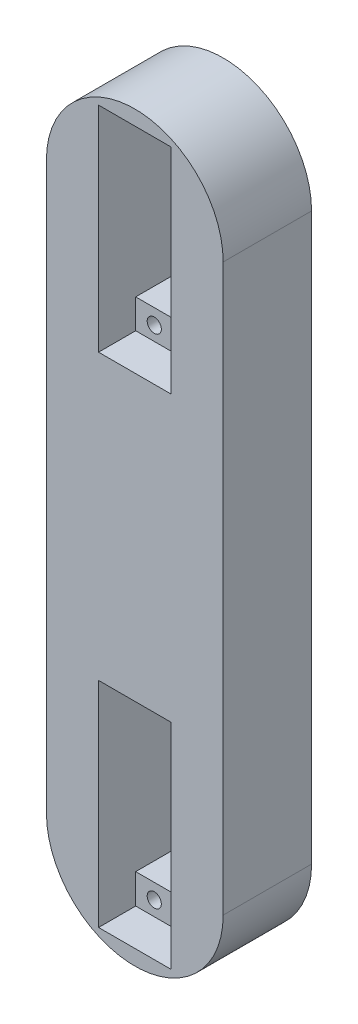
ISO-10303-21;
HEADER;
FILE_DESCRIPTION(('STEP AP214'),'2;1');
FILE_NAME('part.step','',(''),(''),'','','');
FILE_SCHEMA(('AUTOMOTIVE_DESIGN { 1 0 10303 214 1 1 1 1 }'));
ENDSEC;
DATA;
#1=APPLICATION_CONTEXT('core data for automotive mechanical design processes');
#2=APPLICATION_PROTOCOL_DEFINITION('international standard','automotive_design',2000,#1);
#3=PRODUCT_CONTEXT('',#1,'mechanical');
#4=PRODUCT('Part','Part','',(#3));
#5=PRODUCT_RELATED_PRODUCT_CATEGORY('part','',(#4));
#6=PRODUCT_DEFINITION_FORMATION('','',#4);
#7=PRODUCT_DEFINITION_CONTEXT('part definition',#1,'design');
#8=PRODUCT_DEFINITION('design','',#6,#7);
#9=PRODUCT_DEFINITION_SHAPE('','',#8);
#10=(LENGTH_UNIT() NAMED_UNIT(*) SI_UNIT(.MILLI.,.METRE.));
#11=(NAMED_UNIT(*) PLANE_ANGLE_UNIT() SI_UNIT($,.RADIAN.));
#12=(NAMED_UNIT(*) SI_UNIT($,.STERADIAN.) SOLID_ANGLE_UNIT());
#13=UNCERTAINTY_MEASURE_WITH_UNIT(LENGTH_MEASURE(1.E-05),#10,'distance_accuracy_value','');
#14=(GEOMETRIC_REPRESENTATION_CONTEXT(3) GLOBAL_UNCERTAINTY_ASSIGNED_CONTEXT((#13)) GLOBAL_UNIT_ASSIGNED_CONTEXT((#10,
#11,#12)) REPRESENTATION_CONTEXT('',''));
#15=CARTESIAN_POINT('',(0.,0.,0.));
#16=DIRECTION('',(0.,0.,1.));
#17=DIRECTION('',(1.,0.,0.));
#18=AXIS2_PLACEMENT_3D('',#15,#16,#17);
#19=CARTESIAN_POINT('',(5.,-148.153232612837,4.));
#20=DIRECTION('',(0.,0.,1.));
#21=DIRECTION('',(1.,0.,0.));
#22=AXIS2_PLACEMENT_3D('',#19,#20,#21);
#23=CYLINDRICAL_SURFACE('',#22,2.);
#24=CARTESIAN_POINT('',(5.,-148.153232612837,4.));
#25=DIRECTION('',(0.,0.,-1.));
#26=DIRECTION('',(0.,1.,0.));
#27=AXIS2_PLACEMENT_3D('',#24,#25,#26);
#28=CIRCLE('',#27,2.);
#29=CARTESIAN_POINT('',(5.,-146.153232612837,4.));
#30=VERTEX_POINT('',#29);
#31=EDGE_CURVE('E10',#30,#30,#28,.T.);
#32=ORIENTED_EDGE('',*,*,#31,.T.);
#33=EDGE_LOOP('',(#32));
#34=FACE_BOUND('',#33,.T.);
#35=CARTESIAN_POINT('',(5.,-148.153232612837,14.5));
#36=DIRECTION('',(0.,0.,-1.));
#37=DIRECTION('',(-1.,0.,0.));
#38=AXIS2_PLACEMENT_3D('',#35,#36,#37);
#39=CIRCLE('',#38,2.);
#40=CARTESIAN_POINT('',(3.,-148.153232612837,14.5));
#41=VERTEX_POINT('',#40);
#42=EDGE_CURVE('E468',#41,#41,#39,.T.);
#43=ORIENTED_EDGE('',*,*,#42,.F.);
#44=EDGE_LOOP('',(#43));
#45=FACE_BOUND('',#44,.T.);
#46=ADVANCED_FACE('F16',(#34,#45),#23,.F.);
#47=CARTESIAN_POINT('',(5.,-148.153232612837,4.));
#48=DIRECTION('',(0.,0.,-1.));
#49=DIRECTION('',(0.,-1.,0.));
#50=AXIS2_PLACEMENT_3D('',#47,#48,#49);
#51=PLANE('',#50);
#52=ORIENTED_EDGE('',*,*,#31,.F.);
#53=EDGE_LOOP('',(#52));
#54=FACE_BOUND('',#53,.T.);
#55=ADVANCED_FACE('F859',(#54),#51,.F.);
#56=CARTESIAN_POINT('',(5.,-96.0532326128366,4.));
#57=DIRECTION('',(0.,0.,1.));
#58=DIRECTION('',(1.,0.,0.));
#59=AXIS2_PLACEMENT_3D('',#56,#57,#58);
#60=CYLINDRICAL_SURFACE('',#59,2.);
#61=CARTESIAN_POINT('',(5.,-96.0532326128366,4.));
#62=DIRECTION('',(0.,0.,1.));
#63=DIRECTION('',(0.,1.,0.));
#64=AXIS2_PLACEMENT_3D('',#61,#62,#63);
#65=CIRCLE('',#64,2.);
#66=CARTESIAN_POINT('',(5.,-94.0532326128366,4.));
#67=VERTEX_POINT('',#66);
#68=EDGE_CURVE('E27',#67,#67,#65,.T.);
#69=ORIENTED_EDGE('',*,*,#68,.F.);
#70=EDGE_LOOP('',(#69));
#71=FACE_BOUND('',#70,.T.);
#72=CARTESIAN_POINT('',(5.,-96.0532326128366,14.5));
#73=DIRECTION('',(0.,0.,1.));
#74=DIRECTION('',(-1.,0.,0.));
#75=AXIS2_PLACEMENT_3D('',#72,#73,#74);
#76=CIRCLE('',#75,2.);
#77=CARTESIAN_POINT('',(3.,-96.0532326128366,14.5));
#78=VERTEX_POINT('',#77);
#79=EDGE_CURVE('E412',#78,#78,#76,.T.);
#80=ORIENTED_EDGE('',*,*,#79,.T.);
#81=EDGE_LOOP('',(#80));
#82=FACE_BOUND('',#81,.T.);
#83=ADVANCED_FACE('F864',(#71,#82),#60,.F.);
#84=CARTESIAN_POINT('',(5.,-96.0532326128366,4.));
#85=DIRECTION('',(0.,0.,1.));
#86=DIRECTION('',(1.,0.,0.));
#87=AXIS2_PLACEMENT_3D('',#84,#85,#86);
#88=PLANE('',#87);
#89=ORIENTED_EDGE('',*,*,#68,.T.);
#90=EDGE_LOOP('',(#89));
#91=FACE_BOUND('',#90,.T.);
#92=ADVANCED_FACE('F874',(#91),#88,.T.);
#93=CARTESIAN_POINT('',(-5.,-148.153232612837,4.));
#94=DIRECTION('',(0.,0.,1.));
#95=DIRECTION('',(1.,0.,0.));
#96=AXIS2_PLACEMENT_3D('',#93,#94,#95);
#97=CYLINDRICAL_SURFACE('',#96,2.);
#98=CARTESIAN_POINT('',(-5.,-148.153232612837,4.));
#99=DIRECTION('',(0.,0.,1.));
#100=DIRECTION('',(0.,1.,0.));
#101=AXIS2_PLACEMENT_3D('',#98,#99,#100);
#102=CIRCLE('',#101,2.);
#103=CARTESIAN_POINT('',(-5.,-146.153232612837,4.));
#104=VERTEX_POINT('',#103);
#105=EDGE_CURVE('E349',#104,#104,#102,.T.);
#106=ORIENTED_EDGE('',*,*,#105,.F.);
#107=EDGE_LOOP('',(#106));
#108=FACE_BOUND('',#107,.T.);
#109=CARTESIAN_POINT('',(-5.,-148.153232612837,14.5));
#110=DIRECTION('',(0.,0.,1.));
#111=DIRECTION('',(-1.,0.,0.));
#112=AXIS2_PLACEMENT_3D('',#109,#110,#111);
#113=CIRCLE('',#112,2.);
#114=CARTESIAN_POINT('',(-7.,-148.153232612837,14.5));
#115=VERTEX_POINT('',#114);
#116=EDGE_CURVE('E487',#115,#115,#113,.T.);
#117=ORIENTED_EDGE('',*,*,#116,.T.);
#118=EDGE_LOOP('',(#117));
#119=FACE_BOUND('',#118,.T.);
#120=ADVANCED_FACE('F871',(#108,#119),#97,.F.);
#121=CARTESIAN_POINT('',(-5.,-148.153232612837,4.));
#122=DIRECTION('',(0.,0.,1.));
#123=DIRECTION('',(1.,0.,0.));
#124=AXIS2_PLACEMENT_3D('',#121,#122,#123);
#125=PLANE('',#124);
#126=ORIENTED_EDGE('',*,*,#105,.T.);
#127=EDGE_LOOP('',(#126));
#128=FACE_BOUND('',#127,.T.);
#129=ADVANCED_FACE('F18',(#128),#125,.T.);
#130=CARTESIAN_POINT('',(10.250000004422,-152.284914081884,14.5));
#131=DIRECTION('',(0.,1.,0.));
#132=DIRECTION('',(1.,0.,0.));
#133=AXIS2_PLACEMENT_3D('',#130,#131,#132);
#134=PLANE('',#133);
#135=DIRECTION('',(-1.,0.,0.));
#136=VECTOR('',#135,1.);
#137=CARTESIAN_POINT('',(10.250000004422,-152.284914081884,25.));
#138=LINE('',#137,#136);
#139=CARTESIAN_POINT('',(10.250000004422,-152.284914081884,25.));
#140=VERTEX_POINT('',#139);
#141=CARTESIAN_POINT('',(-10.25,-152.284914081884,25.));
#142=VERTEX_POINT('',#141);
#143=EDGE_CURVE('E264',#140,#142,#138,.T.);
#144=ORIENTED_EDGE('',*,*,#143,.F.);
#145=DIRECTION('',(0.,0.,1.));
#146=VECTOR('',#145,1.);
#147=CARTESIAN_POINT('',(10.250000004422,-152.284914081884,14.5));
#148=LINE('',#147,#146);
#149=CARTESIAN_POINT('',(10.250000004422,-152.284914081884,14.5));
#150=VERTEX_POINT('',#149);
#151=EDGE_CURVE('E313',#150,#140,#148,.T.);
#152=ORIENTED_EDGE('',*,*,#151,.F.);
#153=DIRECTION('',(-1.,0.,0.));
#154=VECTOR('',#153,1.);
#155=CARTESIAN_POINT('',(10.250000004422,-152.284914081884,14.5));
#156=LINE('',#155,#154);
#157=CARTESIAN_POINT('',(-10.25,-152.284914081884,14.5));
#158=VERTEX_POINT('',#157);
#159=EDGE_CURVE('E266',#150,#158,#156,.T.);
#160=ORIENTED_EDGE('',*,*,#159,.T.);
#161=DIRECTION('',(0.,0.,1.));
#162=VECTOR('',#161,1.);
#163=CARTESIAN_POINT('',(-10.25,-152.284914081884,14.5));
#164=LINE('',#163,#162);
#165=EDGE_CURVE('E259',#158,#142,#164,.T.);
#166=ORIENTED_EDGE('',*,*,#165,.T.);
#167=EDGE_LOOP('',(#144,#152,#160,#166));
#168=FACE_BOUND('',#167,.T.);
#169=ADVANCED_FACE('F261',(#168),#134,.T.);
#170=CARTESIAN_POINT('',(0.,0.,14.5));
#171=DIRECTION('',(0.,0.,-1.));
#172=DIRECTION('',(0.,-1.,0.));
#173=AXIS2_PLACEMENT_3D('',#170,#171,#172);
#174=PLANE('',#173);
#175=ORIENTED_EDGE('',*,*,#42,.T.);
#176=EDGE_LOOP('',(#175));
#177=FACE_BOUND('',#176,.T.);
#178=ORIENTED_EDGE('',*,*,#116,.F.);
#179=EDGE_LOOP('',(#178));
#180=FACE_BOUND('',#179,.T.);
#181=DIRECTION('',(-1.,0.,0.));
#182=VECTOR('',#181,1.);
#183=CARTESIAN_POINT('',(-10.25,-143.853232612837,14.5));
#184=LINE('',#183,#182);
#185=CARTESIAN_POINT('',(10.25,-143.853232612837,14.5));
#186=VERTEX_POINT('',#185);
#187=CARTESIAN_POINT('',(-10.25,-143.853232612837,14.5));
#188=VERTEX_POINT('',#187);
#189=EDGE_CURVE('E379',#186,#188,#184,.T.);
#190=ORIENTED_EDGE('',*,*,#189,.T.);
#191=DIRECTION('',(0.,1.,0.));
#192=VECTOR('',#191,1.);
#193=CARTESIAN_POINT('',(-10.25,-152.284914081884,14.5));
#194=LINE('',#193,#192);
#195=EDGE_CURVE('E270',#158,#188,#194,.T.);
#196=ORIENTED_EDGE('',*,*,#195,.F.);
#197=ORIENTED_EDGE('',*,*,#159,.F.);
#198=DIRECTION('',(3.65283274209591E-11,-1.,0.));
#199=VECTOR('',#198,1.);
#200=CARTESIAN_POINT('',(10.250000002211,-91.7569140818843,14.5));
#201=LINE('',#200,#199);
#202=EDGE_CURVE('E309',#186,#150,#201,.T.);
#203=ORIENTED_EDGE('',*,*,#202,.F.);
#204=EDGE_LOOP('',(#190,#196,#197,#203));
#205=FACE_BOUND('',#204,.T.);
#206=ADVANCED_FACE('F920',(#177,#180,#205),#174,.F.);
#207=CARTESIAN_POINT('',(-5.,-96.0532326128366,4.));
#208=DIRECTION('',(0.,0.,1.));
#209=DIRECTION('',(1.,0.,0.));
#210=AXIS2_PLACEMENT_3D('',#207,#208,#209);
#211=CYLINDRICAL_SURFACE('',#210,2.);
#212=CARTESIAN_POINT('',(-5.,-96.0532326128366,4.));
#213=DIRECTION('',(0.,0.,1.));
#214=DIRECTION('',(0.,1.,0.));
#215=AXIS2_PLACEMENT_3D('',#212,#213,#214);
#216=CIRCLE('',#215,2.);
#217=CARTESIAN_POINT('',(-5.,-94.0532326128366,4.));
#218=VERTEX_POINT('',#217);
#219=EDGE_CURVE('E418',#218,#218,#216,.T.);
#220=ORIENTED_EDGE('',*,*,#219,.F.);
#221=EDGE_LOOP('',(#220));
#222=FACE_BOUND('',#221,.T.);
#223=CARTESIAN_POINT('',(-5.,-96.0532326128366,14.5));
#224=DIRECTION('',(0.,0.,1.));
#225=DIRECTION('',(-1.,0.,0.));
#226=AXIS2_PLACEMENT_3D('',#223,#224,#225);
#227=CIRCLE('',#226,2.);
#228=CARTESIAN_POINT('',(-7.,-96.0532326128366,14.5));
#229=VERTEX_POINT('',#228);
#230=EDGE_CURVE('E318',#229,#229,#227,.T.);
#231=ORIENTED_EDGE('',*,*,#230,.T.);
#232=EDGE_LOOP('',(#231));
#233=FACE_BOUND('',#232,.T.);
#234=ADVANCED_FACE('F918',(#222,#233),#211,.F.);
#235=CARTESIAN_POINT('',(-5.,-96.0532326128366,4.));
#236=DIRECTION('',(0.,0.,1.));
#237=DIRECTION('',(1.,0.,0.));
#238=AXIS2_PLACEMENT_3D('',#235,#236,#237);
#239=PLANE('',#238);
#240=ORIENTED_EDGE('',*,*,#219,.T.);
#241=EDGE_LOOP('',(#240));
#242=FACE_BOUND('',#241,.T.);
#243=ADVANCED_FACE('F914',(#242),#239,.T.);
#244=CARTESIAN_POINT('',(-10.25,-91.7569140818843,14.5));
#245=DIRECTION('',(0.,-1.,0.));
#246=DIRECTION('',(0.,0.,-1.));
#247=AXIS2_PLACEMENT_3D('',#244,#245,#246);
#248=PLANE('',#247);
#249=DIRECTION('',(1.,0.,0.));
#250=VECTOR('',#249,1.);
#251=CARTESIAN_POINT('',(-10.25,-91.7569140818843,25.));
#252=LINE('',#251,#250);
#253=CARTESIAN_POINT('',(-10.25,-91.7569140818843,25.));
#254=VERTEX_POINT('',#253);
#255=CARTESIAN_POINT('',(10.250000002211,-91.7569140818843,25.));
#256=VERTEX_POINT('',#255);
#257=EDGE_CURVE('E294',#254,#256,#252,.T.);
#258=ORIENTED_EDGE('',*,*,#257,.F.);
#259=DIRECTION('',(0.,0.,1.));
#260=VECTOR('',#259,1.);
#261=CARTESIAN_POINT('',(-10.25,-91.7569140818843,14.5));
#262=LINE('',#261,#260);
#263=CARTESIAN_POINT('',(-10.25,-91.7569140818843,14.5));
#264=VERTEX_POINT('',#263);
#265=EDGE_CURVE('E271',#264,#254,#262,.T.);
#266=ORIENTED_EDGE('',*,*,#265,.F.);
#267=DIRECTION('',(1.,0.,0.));
#268=VECTOR('',#267,1.);
#269=CARTESIAN_POINT('',(-10.25,-91.7569140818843,14.5));
#270=LINE('',#269,#268);
#271=CARTESIAN_POINT('',(10.250000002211,-91.7569140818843,14.5));
#272=VERTEX_POINT('',#271);
#273=EDGE_CURVE('E315',#264,#272,#270,.T.);
#274=ORIENTED_EDGE('',*,*,#273,.T.);
#275=DIRECTION('',(0.,0.,1.));
#276=VECTOR('',#275,1.);
#277=CARTESIAN_POINT('',(10.250000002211,-91.7569140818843,14.5));
#278=LINE('',#277,#276);
#279=EDGE_CURVE('E308',#272,#256,#278,.T.);
#280=ORIENTED_EDGE('',*,*,#279,.T.);
#281=EDGE_LOOP('',(#258,#266,#274,#280));
#282=FACE_BOUND('',#281,.T.);
#283=ADVANCED_FACE('F911',(#282),#248,.T.);
#284=CARTESIAN_POINT('',(0.,0.,14.5));
#285=DIRECTION('',(0.,0.,-1.));
#286=DIRECTION('',(0.,-1.,0.));
#287=AXIS2_PLACEMENT_3D('',#284,#285,#286);
#288=PLANE('',#287);
#289=ORIENTED_EDGE('',*,*,#79,.F.);
#290=EDGE_LOOP('',(#289));
#291=FACE_BOUND('',#290,.T.);
#292=ORIENTED_EDGE('',*,*,#230,.F.);
#293=EDGE_LOOP('',(#292));
#294=FACE_BOUND('',#293,.T.);
#295=DIRECTION('',(1.,0.,0.));
#296=VECTOR('',#295,1.);
#297=CARTESIAN_POINT('',(-10.25,-100.353232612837,14.5));
#298=LINE('',#297,#296);
#299=CARTESIAN_POINT('',(-10.25,-100.353232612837,14.5));
#300=VERTEX_POINT('',#299);
#301=CARTESIAN_POINT('',(10.250000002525,-100.353232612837,14.5));
#302=VERTEX_POINT('',#301);
#303=EDGE_CURVE('E431',#300,#302,#298,.T.);
#304=ORIENTED_EDGE('',*,*,#303,.T.);
#305=DIRECTION('',(3.65283274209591E-11,-1.,0.));
#306=VECTOR('',#305,1.);
#307=CARTESIAN_POINT('',(10.250000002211,-91.7569140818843,14.5));
#308=LINE('',#307,#306);
#309=EDGE_CURVE('E304',#272,#302,#308,.T.);
#310=ORIENTED_EDGE('',*,*,#309,.F.);
#311=ORIENTED_EDGE('',*,*,#273,.F.);
#312=DIRECTION('',(0.,1.,0.));
#313=VECTOR('',#312,1.);
#314=CARTESIAN_POINT('',(-10.25,-152.284914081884,14.5));
#315=LINE('',#314,#313);
#316=EDGE_CURVE('E323',#300,#264,#315,.T.);
#317=ORIENTED_EDGE('',*,*,#316,.F.);
#318=EDGE_LOOP('',(#304,#310,#311,#317));
#319=FACE_BOUND('',#318,.T.);
#320=ADVANCED_FACE('F844',(#291,#294,#319),#288,.F.);
#321=CARTESIAN_POINT('',(5.,44.7431326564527,4.));
#322=DIRECTION('',(0.,0.,1.));
#323=DIRECTION('',(1.,0.,0.));
#324=AXIS2_PLACEMENT_3D('',#321,#322,#323);
#325=CYLINDRICAL_SURFACE('',#324,2.);
#326=CARTESIAN_POINT('',(5.,44.7431326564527,14.5));
#327=DIRECTION('',(0.,0.,-1.));
#328=DIRECTION('',(1.,0.,0.));
#329=AXIS2_PLACEMENT_3D('',#326,#327,#328);
#330=CIRCLE('',#329,2.);
#331=CARTESIAN_POINT('',(7.,44.7431326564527,14.5));
#332=VERTEX_POINT('',#331);
#333=EDGE_CURVE('E400',#332,#332,#330,.T.);
#334=ORIENTED_EDGE('',*,*,#333,.F.);
#335=EDGE_LOOP('',(#334));
#336=FACE_BOUND('',#335,.T.);
#337=CARTESIAN_POINT('',(5.,44.7431326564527,4.));
#338=DIRECTION('',(0.,0.,1.));
#339=DIRECTION('',(0.,1.,0.));
#340=AXIS2_PLACEMENT_3D('',#337,#338,#339);
#341=CIRCLE('',#340,2.);
#342=CARTESIAN_POINT('',(5.,46.7431326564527,4.));
#343=VERTEX_POINT('',#342);
#344=EDGE_CURVE('E319',#343,#343,#341,.T.);
#345=ORIENTED_EDGE('',*,*,#344,.F.);
#346=EDGE_LOOP('',(#345));
#347=FACE_BOUND('',#346,.T.);
#348=ADVANCED_FACE('F840',(#336,#347),#325,.F.);
#349=CARTESIAN_POINT('',(5.,44.7431326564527,4.));
#350=DIRECTION('',(0.,0.,1.));
#351=DIRECTION('',(1.,0.,0.));
#352=AXIS2_PLACEMENT_3D('',#349,#350,#351);
#353=PLANE('',#352);
#354=ORIENTED_EDGE('',*,*,#344,.T.);
#355=EDGE_LOOP('',(#354));
#356=FACE_BOUND('',#355,.T.);
#357=ADVANCED_FACE('F843',(#356),#353,.T.);
#358=CARTESIAN_POINT('',(5.,-7.35686734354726,4.));
#359=DIRECTION('',(0.,0.,1.));
#360=DIRECTION('',(1.,0.,0.));
#361=AXIS2_PLACEMENT_3D('',#358,#359,#360);
#362=CYLINDRICAL_SURFACE('',#361,2.);
#363=CARTESIAN_POINT('',(5.,-7.35686734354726,14.5));
#364=DIRECTION('',(0.,0.,-1.));
#365=DIRECTION('',(1.,0.,0.));
#366=AXIS2_PLACEMENT_3D('',#363,#364,#365);
#367=CIRCLE('',#366,2.);
#368=CARTESIAN_POINT('',(7.,-7.35686734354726,14.5));
#369=VERTEX_POINT('',#368);
#370=EDGE_CURVE('E465',#369,#369,#367,.T.);
#371=ORIENTED_EDGE('',*,*,#370,.F.);
#372=EDGE_LOOP('',(#371));
#373=FACE_BOUND('',#372,.T.);
#374=CARTESIAN_POINT('',(5.,-7.35686734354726,4.));
#375=DIRECTION('',(0.,0.,1.));
#376=DIRECTION('',(0.,1.,0.));
#377=AXIS2_PLACEMENT_3D('',#374,#375,#376);
#378=CIRCLE('',#377,2.);
#379=CARTESIAN_POINT('',(5.,-5.35686734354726,4.));
#380=VERTEX_POINT('',#379);
#381=EDGE_CURVE('E409',#380,#380,#378,.T.);
#382=ORIENTED_EDGE('',*,*,#381,.F.);
#383=EDGE_LOOP('',(#382));
#384=FACE_BOUND('',#383,.T.);
#385=ADVANCED_FACE('F849',(#373,#384),#362,.F.);
#386=CARTESIAN_POINT('',(5.,-7.35686734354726,4.));
#387=DIRECTION('',(0.,0.,1.));
#388=DIRECTION('',(1.,0.,0.));
#389=AXIS2_PLACEMENT_3D('',#386,#387,#388);
#390=PLANE('',#389);
#391=ORIENTED_EDGE('',*,*,#381,.T.);
#392=EDGE_LOOP('',(#391));
#393=FACE_BOUND('',#392,.T.);
#394=ADVANCED_FACE('F854',(#393),#390,.T.);
#395=CARTESIAN_POINT('',(-5.,44.7431326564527,4.));
#396=DIRECTION('',(0.,0.,1.));
#397=DIRECTION('',(1.,0.,0.));
#398=AXIS2_PLACEMENT_3D('',#395,#396,#397);
#399=CYLINDRICAL_SURFACE('',#398,2.);
#400=CARTESIAN_POINT('',(-5.,44.7431326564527,14.5));
#401=DIRECTION('',(0.,0.,1.));
#402=DIRECTION('',(1.,0.,0.));
#403=AXIS2_PLACEMENT_3D('',#400,#401,#402);
#404=CIRCLE('',#403,2.);
#405=CARTESIAN_POINT('',(-3.,44.7431326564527,14.5));
#406=VERTEX_POINT('',#405);
#407=EDGE_CURVE('E521',#406,#406,#404,.T.);
#408=ORIENTED_EDGE('',*,*,#407,.T.);
#409=EDGE_LOOP('',(#408));
#410=FACE_BOUND('',#409,.T.);
#411=CARTESIAN_POINT('',(-5.,44.7431326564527,4.));
#412=DIRECTION('',(0.,0.,-1.));
#413=DIRECTION('',(0.,1.,0.));
#414=AXIS2_PLACEMENT_3D('',#411,#412,#413);
#415=CIRCLE('',#414,2.);
#416=CARTESIAN_POINT('',(-5.,46.7431326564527,4.));
#417=VERTEX_POINT('',#416);
#418=EDGE_CURVE('E438',#417,#417,#415,.T.);
#419=ORIENTED_EDGE('',*,*,#418,.T.);
#420=EDGE_LOOP('',(#419));
#421=FACE_BOUND('',#420,.T.);
#422=ADVANCED_FACE('F832',(#410,#421),#399,.F.);
#423=CARTESIAN_POINT('',(-5.,44.7431326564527,4.));
#424=DIRECTION('',(0.,0.,-1.));
#425=DIRECTION('',(0.,-1.,0.));
#426=AXIS2_PLACEMENT_3D('',#423,#424,#425);
#427=PLANE('',#426);
#428=ORIENTED_EDGE('',*,*,#418,.F.);
#429=EDGE_LOOP('',(#428));
#430=FACE_BOUND('',#429,.T.);
#431=ADVANCED_FACE('F879',(#430),#427,.F.);
#432=CARTESIAN_POINT('',(10.250000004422,49.1711793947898,14.5));
#433=DIRECTION('',(0.,1.,0.));
#434=DIRECTION('',(1.,0.,0.));
#435=AXIS2_PLACEMENT_3D('',#432,#433,#434);
#436=PLANE('',#435);
#437=DIRECTION('',(-1.,0.,0.));
#438=VECTOR('',#437,1.);
#439=CARTESIAN_POINT('',(10.250000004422,49.1711793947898,25.));
#440=LINE('',#439,#438);
#441=CARTESIAN_POINT('',(10.250000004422,49.1711793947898,25.));
#442=VERTEX_POINT('',#441);
#443=CARTESIAN_POINT('',(-10.25,49.1711793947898,25.));
#444=VERTEX_POINT('',#443);
#445=EDGE_CURVE('E429',#442,#444,#440,.T.);
#446=ORIENTED_EDGE('',*,*,#445,.T.);
#447=DIRECTION('',(0.,0.,1.));
#448=VECTOR('',#447,1.);
#449=CARTESIAN_POINT('',(-10.25,49.1711793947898,14.5));
#450=LINE('',#449,#448);
#451=CARTESIAN_POINT('',(-10.25,49.1711793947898,14.5));
#452=VERTEX_POINT('',#451);
#453=EDGE_CURVE('E406',#452,#444,#450,.T.);
#454=ORIENTED_EDGE('',*,*,#453,.F.);
#455=DIRECTION('',(-1.,0.,0.));
#456=VECTOR('',#455,1.);
#457=CARTESIAN_POINT('',(10.250000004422,49.1711793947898,14.5));
#458=LINE('',#457,#456);
#459=CARTESIAN_POINT('',(10.250000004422,49.1711793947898,14.5));
#460=VERTEX_POINT('',#459);
#461=EDGE_CURVE('E513',#460,#452,#458,.T.);
#462=ORIENTED_EDGE('',*,*,#461,.F.);
#463=DIRECTION('',(0.,0.,1.));
#464=VECTOR('',#463,1.);
#465=CARTESIAN_POINT('',(10.250000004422,49.1711793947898,14.5));
#466=LINE('',#465,#464);
#467=EDGE_CURVE('E363',#460,#442,#466,.T.);
#468=ORIENTED_EDGE('',*,*,#467,.T.);
#469=EDGE_LOOP('',(#446,#454,#462,#468));
#470=FACE_BOUND('',#469,.T.);
#471=ADVANCED_FACE('F588',(#470),#436,.F.);
#472=CARTESIAN_POINT('',(0.,0.,14.5));
#473=DIRECTION('',(0.,0.,1.));
#474=DIRECTION('',(1.,0.,0.));
#475=AXIS2_PLACEMENT_3D('',#472,#473,#474);
#476=PLANE('',#475);
#477=DIRECTION('',(1.,0.,0.));
#478=VECTOR('',#477,1.);
#479=CARTESIAN_POINT('',(-10.25,40.4431326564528,14.5));
#480=LINE('',#479,#478);
#481=CARTESIAN_POINT('',(-10.25,40.4431326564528,14.5));
#482=VERTEX_POINT('',#481);
#483=CARTESIAN_POINT('',(10.2500000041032,40.4431326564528,14.5));
#484=VERTEX_POINT('',#483);
#485=EDGE_CURVE('E384',#482,#484,#480,.T.);
#486=ORIENTED_EDGE('',*,*,#485,.T.);
#487=DIRECTION('',(3.65283274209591E-11,1.,0.));
#488=VECTOR('',#487,1.);
#489=CARTESIAN_POINT('',(10.250000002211,-11.3568206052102,14.5));
#490=LINE('',#489,#488);
#491=EDGE_CURVE('E366',#484,#460,#490,.T.);
#492=ORIENTED_EDGE('',*,*,#491,.T.);
#493=ORIENTED_EDGE('',*,*,#461,.T.);
#494=DIRECTION('',(0.,-1.,0.));
#495=VECTOR('',#494,1.);
#496=CARTESIAN_POINT('',(-10.25,49.1711793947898,14.5));
#497=LINE('',#496,#495);
#498=EDGE_CURVE('E388',#452,#482,#497,.T.);
#499=ORIENTED_EDGE('',*,*,#498,.T.);
#500=EDGE_LOOP('',(#486,#492,#493,#499));
#501=FACE_BOUND('',#500,.T.);
#502=ORIENTED_EDGE('',*,*,#407,.F.);
#503=EDGE_LOOP('',(#502));
#504=FACE_BOUND('',#503,.T.);
#505=ORIENTED_EDGE('',*,*,#333,.T.);
#506=EDGE_LOOP('',(#505));
#507=FACE_BOUND('',#506,.T.);
#508=ADVANCED_FACE('F585',(#501,#504,#507),#476,.T.);
#509=CARTESIAN_POINT('',(-5.,-7.35686734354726,4.));
#510=DIRECTION('',(0.,0.,1.));
#511=DIRECTION('',(1.,0.,0.));
#512=AXIS2_PLACEMENT_3D('',#509,#510,#511);
#513=CYLINDRICAL_SURFACE('',#512,2.);
#514=CARTESIAN_POINT('',(-5.,-7.35686734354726,14.5));
#515=DIRECTION('',(0.,0.,1.));
#516=DIRECTION('',(1.,0.,0.));
#517=AXIS2_PLACEMENT_3D('',#514,#515,#516);
#518=CIRCLE('',#517,2.);
#519=CARTESIAN_POINT('',(-3.,-7.35686734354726,14.5));
#520=VERTEX_POINT('',#519);
#521=EDGE_CURVE('E462',#520,#520,#518,.T.);
#522=ORIENTED_EDGE('',*,*,#521,.T.);
#523=EDGE_LOOP('',(#522));
#524=FACE_BOUND('',#523,.T.);
#525=CARTESIAN_POINT('',(-5.,-7.35686734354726,4.));
#526=DIRECTION('',(0.,0.,-1.));
#527=DIRECTION('',(0.,1.,0.));
#528=AXIS2_PLACEMENT_3D('',#525,#526,#527);
#529=CIRCLE('',#528,2.);
#530=CARTESIAN_POINT('',(-5.,-5.35686734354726,4.));
#531=VERTEX_POINT('',#530);
#532=EDGE_CURVE('E397',#531,#531,#529,.T.);
#533=ORIENTED_EDGE('',*,*,#532,.T.);
#534=EDGE_LOOP('',(#533));
#535=FACE_BOUND('',#534,.T.);
#536=ADVANCED_FACE('F836',(#524,#535),#513,.F.);
#537=CARTESIAN_POINT('',(-5.,-7.35686734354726,4.));
#538=DIRECTION('',(0.,0.,-1.));
#539=DIRECTION('',(0.,-1.,0.));
#540=AXIS2_PLACEMENT_3D('',#537,#538,#539);
#541=PLANE('',#540);
#542=ORIENTED_EDGE('',*,*,#532,.F.);
#543=EDGE_LOOP('',(#542));
#544=FACE_BOUND('',#543,.T.);
#545=ADVANCED_FACE('F891',(#544),#541,.F.);
#546=CARTESIAN_POINT('',(-10.25,-11.3568206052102,14.5));
#547=DIRECTION('',(0.,-1.,0.));
#548=DIRECTION('',(0.,0.,-1.));
#549=AXIS2_PLACEMENT_3D('',#546,#547,#548);
#550=PLANE('',#549);
#551=DIRECTION('',(1.,0.,0.));
#552=VECTOR('',#551,1.);
#553=CARTESIAN_POINT('',(-10.25,-11.3568206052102,25.));
#554=LINE('',#553,#552);
#555=CARTESIAN_POINT('',(-10.25,-11.3568206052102,25.));
#556=VERTEX_POINT('',#555);
#557=CARTESIAN_POINT('',(10.250000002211,-11.3568206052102,25.));
#558=VERTEX_POINT('',#557);
#559=EDGE_CURVE('E368',#556,#558,#554,.T.);
#560=ORIENTED_EDGE('',*,*,#559,.T.);
#561=DIRECTION('',(0.,0.,1.));
#562=VECTOR('',#561,1.);
#563=CARTESIAN_POINT('',(10.250000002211,-11.3568206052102,14.5));
#564=LINE('',#563,#562);
#565=CARTESIAN_POINT('',(10.250000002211,-11.3568206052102,14.5));
#566=VERTEX_POINT('',#565);
#567=EDGE_CURVE('E367',#566,#558,#564,.T.);
#568=ORIENTED_EDGE('',*,*,#567,.F.);
#569=DIRECTION('',(1.,0.,0.));
#570=VECTOR('',#569,1.);
#571=CARTESIAN_POINT('',(-10.25,-11.3568206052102,14.5));
#572=LINE('',#571,#570);
#573=CARTESIAN_POINT('',(-10.25,-11.3568206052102,14.5));
#574=VERTEX_POINT('',#573);
#575=EDGE_CURVE('E401',#574,#566,#572,.T.);
#576=ORIENTED_EDGE('',*,*,#575,.F.);
#577=DIRECTION('',(0.,0.,1.));
#578=VECTOR('',#577,1.);
#579=CARTESIAN_POINT('',(-10.25,-11.3568206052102,14.5));
#580=LINE('',#579,#578);
#581=EDGE_CURVE('E402',#574,#556,#580,.T.);
#582=ORIENTED_EDGE('',*,*,#581,.T.);
#583=EDGE_LOOP('',(#560,#568,#576,#582));
#584=FACE_BOUND('',#583,.T.);
#585=ADVANCED_FACE('F894',(#584),#550,.F.);
#586=CARTESIAN_POINT('',(0.,0.,14.5));
#587=DIRECTION('',(0.,0.,1.));
#588=DIRECTION('',(1.,0.,0.));
#589=AXIS2_PLACEMENT_3D('',#586,#587,#588);
#590=PLANE('',#589);
#591=DIRECTION('',(-1.,0.,0.));
#592=VECTOR('',#591,1.);
#593=CARTESIAN_POINT('',(-10.25,-3.05686734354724,14.5));
#594=LINE('',#593,#592);
#595=CARTESIAN_POINT('',(10.25,-3.05686734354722,14.5));
#596=VERTEX_POINT('',#595);
#597=CARTESIAN_POINT('',(-10.25,-3.05686734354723,14.5));
#598=VERTEX_POINT('',#597);
#599=EDGE_CURVE('E330',#596,#598,#594,.T.);
#600=ORIENTED_EDGE('',*,*,#599,.T.);
#601=DIRECTION('',(0.,-1.,0.));
#602=VECTOR('',#601,1.);
#603=CARTESIAN_POINT('',(-10.25,49.1711793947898,14.5));
#604=LINE('',#603,#602);
#605=EDGE_CURVE('E405',#598,#574,#604,.T.);
#606=ORIENTED_EDGE('',*,*,#605,.T.);
#607=ORIENTED_EDGE('',*,*,#575,.T.);
#608=DIRECTION('',(3.65283274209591E-11,1.,0.));
#609=VECTOR('',#608,1.);
#610=CARTESIAN_POINT('',(10.250000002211,-11.3568206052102,14.5));
#611=LINE('',#610,#609);
#612=EDGE_CURVE('E423',#566,#596,#611,.T.);
#613=ORIENTED_EDGE('',*,*,#612,.T.);
#614=EDGE_LOOP('',(#600,#606,#607,#613));
#615=FACE_BOUND('',#614,.T.);
#616=ORIENTED_EDGE('',*,*,#521,.F.);
#617=EDGE_LOOP('',(#616));
#618=FACE_BOUND('',#617,.T.);
#619=ORIENTED_EDGE('',*,*,#370,.T.);
#620=EDGE_LOOP('',(#619));
#621=FACE_BOUND('',#620,.T.);
#622=ADVANCED_FACE('F896',(#615,#618,#621),#590,.T.);
#623=CARTESIAN_POINT('',(0.,0.,4.));
#624=DIRECTION('',(0.,0.,-1.));
#625=DIRECTION('',(0.,-1.,0.));
#626=AXIS2_PLACEMENT_3D('',#623,#624,#625);
#627=PLANE('',#626);
#628=DIRECTION('',(-1.,0.,0.));
#629=VECTOR('',#628,1.);
#630=CARTESIAN_POINT('',(-10.25,-143.853232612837,4.));
#631=LINE('',#630,#629);
#632=CARTESIAN_POINT('',(10.25,-143.853232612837,4.));
#633=VERTEX_POINT('',#632);
#634=CARTESIAN_POINT('',(-10.25,-143.853232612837,4.));
#635=VERTEX_POINT('',#634);
#636=EDGE_CURVE('E500',#633,#635,#631,.T.);
#637=ORIENTED_EDGE('',*,*,#636,.F.);
#638=DIRECTION('',(0.,-1.,0.));
#639=VECTOR('',#638,1.);
#640=CARTESIAN_POINT('',(10.25,-100.353232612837,4.));
#641=LINE('',#640,#639);
#642=CARTESIAN_POINT('',(10.25,-100.353232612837,4.));
#643=VERTEX_POINT('',#642);
#644=EDGE_CURVE('E307',#643,#633,#641,.T.);
#645=ORIENTED_EDGE('',*,*,#644,.F.);
#646=DIRECTION('',(1.,0.,0.));
#647=VECTOR('',#646,1.);
#648=CARTESIAN_POINT('',(-10.25,-100.353232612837,4.));
#649=LINE('',#648,#647);
#650=CARTESIAN_POINT('',(-10.25,-100.353232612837,4.));
#651=VERTEX_POINT('',#650);
#652=EDGE_CURVE('E435',#651,#643,#649,.T.);
#653=ORIENTED_EDGE('',*,*,#652,.F.);
#654=DIRECTION('',(0.,1.,0.));
#655=VECTOR('',#654,1.);
#656=CARTESIAN_POINT('',(-10.25,-143.853232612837,4.));
#657=LINE('',#656,#655);
#658=EDGE_CURVE('E375',#635,#651,#657,.T.);
#659=ORIENTED_EDGE('',*,*,#658,.F.);
#660=EDGE_LOOP('',(#637,#645,#653,#659));
#661=FACE_BOUND('',#660,.T.);
#662=CARTESIAN_POINT('',(0.,-131.705049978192,4.));
#663=DIRECTION('',(0.,0.,-1.));
#664=DIRECTION('',(-1.,0.,0.));
#665=AXIS2_PLACEMENT_3D('',#662,#663,#664);
#666=CIRCLE('',#665,9.);
#667=CARTESIAN_POINT('',(-9.,-131.705049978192,4.));
#668=VERTEX_POINT('',#667);
#669=EDGE_CURVE('E20',#668,#668,#666,.T.);
#670=ORIENTED_EDGE('',*,*,#669,.T.);
#671=EDGE_LOOP('',(#670));
#672=FACE_BOUND('',#671,.T.);
#673=ADVANCED_FACE('F899',(#661,#672),#627,.F.);
#674=CARTESIAN_POINT('',(10.25,-100.353232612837,4.));
#675=DIRECTION('',(-1.,0.,0.));
#676=DIRECTION('',(0.,0.,1.));
#677=AXIS2_PLACEMENT_3D('',#674,#675,#676);
#678=PLANE('',#677);
#679=DIRECTION('',(0.,0.,1.));
#680=VECTOR('',#679,1.);
#681=CARTESIAN_POINT('',(10.25,-143.853232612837,4.));
#682=LINE('',#681,#680);
#683=EDGE_CURVE('E496',#633,#186,#682,.T.);
#684=ORIENTED_EDGE('',*,*,#683,.T.);
#685=ORIENTED_EDGE('',*,*,#202,.T.);
#686=ORIENTED_EDGE('',*,*,#151,.T.);
#687=DIRECTION('',(0.,1.,0.));
#688=VECTOR('',#687,1.);
#689=CARTESIAN_POINT('',(10.25,28.3690413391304,25.));
#690=LINE('',#689,#688);
#691=EDGE_CURVE('E287',#140,#256,#690,.T.);
#692=ORIENTED_EDGE('',*,*,#691,.T.);
#693=ORIENTED_EDGE('',*,*,#279,.F.);
#694=ORIENTED_EDGE('',*,*,#309,.T.);
#695=DIRECTION('',(0.,0.,1.));
#696=VECTOR('',#695,1.);
#697=CARTESIAN_POINT('',(10.25,-100.353232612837,4.));
#698=LINE('',#697,#696);
#699=EDGE_CURVE('E314',#643,#302,#698,.T.);
#700=ORIENTED_EDGE('',*,*,#699,.F.);
#701=ORIENTED_EDGE('',*,*,#644,.T.);
#702=EDGE_LOOP('',(#684,#685,#686,#692,#693,#694,#700,#701));
#703=FACE_BOUND('',#702,.T.);
#704=ADVANCED_FACE('F903',(#703),#678,.T.);
#705=CARTESIAN_POINT('',(-10.25,-100.353232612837,4.));
#706=DIRECTION('',(0.,-1.,0.));
#707=DIRECTION('',(-1.,0.,0.));
#708=AXIS2_PLACEMENT_3D('',#705,#706,#707);
#709=PLANE('',#708);
#710=ORIENTED_EDGE('',*,*,#303,.F.);
#711=DIRECTION('',(0.,0.,1.));
#712=VECTOR('',#711,1.);
#713=CARTESIAN_POINT('',(-10.25,-100.353232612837,4.));
#714=LINE('',#713,#712);
#715=EDGE_CURVE('E320',#651,#300,#714,.T.);
#716=ORIENTED_EDGE('',*,*,#715,.F.);
#717=ORIENTED_EDGE('',*,*,#652,.T.);
#718=ORIENTED_EDGE('',*,*,#699,.T.);
#719=EDGE_LOOP('',(#710,#716,#717,#718));
#720=FACE_BOUND('',#719,.T.);
#721=ADVANCED_FACE('F924',(#720),#709,.T.);
#722=CARTESIAN_POINT('',(-10.25,-143.853232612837,4.));
#723=DIRECTION('',(1.,0.,0.));
#724=DIRECTION('',(0.,-1.,0.));
#725=AXIS2_PLACEMENT_3D('',#722,#723,#724);
#726=PLANE('',#725);
#727=ORIENTED_EDGE('',*,*,#715,.T.);
#728=ORIENTED_EDGE('',*,*,#316,.T.);
#729=ORIENTED_EDGE('',*,*,#265,.T.);
#730=DIRECTION('',(0.,-1.,0.));
#731=VECTOR('',#730,1.);
#732=CARTESIAN_POINT('',(-10.25,28.3690413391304,25.));
#733=LINE('',#732,#731);
#734=EDGE_CURVE('E274',#254,#142,#733,.T.);
#735=ORIENTED_EDGE('',*,*,#734,.T.);
#736=ORIENTED_EDGE('',*,*,#165,.F.);
#737=ORIENTED_EDGE('',*,*,#195,.T.);
#738=DIRECTION('',(0.,0.,1.));
#739=VECTOR('',#738,1.);
#740=CARTESIAN_POINT('',(-10.25,-143.853232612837,4.));
#741=LINE('',#740,#739);
#742=EDGE_CURVE('E324',#635,#188,#741,.T.);
#743=ORIENTED_EDGE('',*,*,#742,.F.);
#744=ORIENTED_EDGE('',*,*,#658,.T.);
#745=EDGE_LOOP('',(#727,#728,#729,#735,#736,#737,#743,#744));
#746=FACE_BOUND('',#745,.T.);
#747=ADVANCED_FACE('F276',(#746),#726,.T.);
#748=CARTESIAN_POINT('',(-10.25,-143.853232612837,4.));
#749=DIRECTION('',(0.,1.,0.));
#750=DIRECTION('',(1.,0.,0.));
#751=AXIS2_PLACEMENT_3D('',#748,#749,#750);
#752=PLANE('',#751);
#753=ORIENTED_EDGE('',*,*,#189,.F.);
#754=ORIENTED_EDGE('',*,*,#683,.F.);
#755=ORIENTED_EDGE('',*,*,#636,.T.);
#756=ORIENTED_EDGE('',*,*,#742,.T.);
#757=EDGE_LOOP('',(#753,#754,#755,#756));
#758=FACE_BOUND('',#757,.T.);
#759=ADVANCED_FACE('F948',(#758),#752,.T.);
#760=CARTESIAN_POINT('',(10.25,-3.05686734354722,4.));
#761=DIRECTION('',(1.,0.,0.));
#762=DIRECTION('',(0.,1.,0.));
#763=AXIS2_PLACEMENT_3D('',#760,#761,#762);
#764=PLANE('',#763);
#765=DIRECTION('',(0.,0.,1.));
#766=VECTOR('',#765,1.);
#767=CARTESIAN_POINT('',(10.25,-3.05686734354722,4.));
#768=LINE('',#767,#766);
#769=CARTESIAN_POINT('',(10.25,-3.05686734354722,4.));
#770=VERTEX_POINT('',#769);
#771=EDGE_CURVE('E325',#770,#596,#768,.T.);
#772=ORIENTED_EDGE('',*,*,#771,.T.);
#773=ORIENTED_EDGE('',*,*,#612,.F.);
#774=ORIENTED_EDGE('',*,*,#567,.T.);
#775=DIRECTION('',(0.,-1.,0.));
#776=VECTOR('',#775,1.);
#777=CARTESIAN_POINT('',(10.25,28.3690413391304,25.));
#778=LINE('',#777,#776);
#779=EDGE_CURVE('E372',#442,#558,#778,.T.);
#780=ORIENTED_EDGE('',*,*,#779,.F.);
#781=ORIENTED_EDGE('',*,*,#467,.F.);
#782=ORIENTED_EDGE('',*,*,#491,.F.);
#783=DIRECTION('',(0.,0.,1.));
#784=VECTOR('',#783,1.);
#785=CARTESIAN_POINT('',(10.25,40.4431326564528,4.));
#786=LINE('',#785,#784);
#787=CARTESIAN_POINT('',(10.25,40.4431326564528,4.));
#788=VERTEX_POINT('',#787);
#789=EDGE_CURVE('E350',#788,#484,#786,.T.);
#790=ORIENTED_EDGE('',*,*,#789,.F.);
#791=DIRECTION('',(0.,1.,0.));
#792=VECTOR('',#791,1.);
#793=CARTESIAN_POINT('',(10.25,-3.05686734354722,4.));
#794=LINE('',#793,#792);
#795=EDGE_CURVE('E385',#770,#788,#794,.T.);
#796=ORIENTED_EDGE('',*,*,#795,.F.);
#797=EDGE_LOOP('',(#772,#773,#774,#780,#781,#782,#790,#796));
#798=FACE_BOUND('',#797,.T.);
#799=ADVANCED_FACE('F574',(#798),#764,.F.);
#800=CARTESIAN_POINT('',(-10.25,40.4431326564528,4.));
#801=DIRECTION('',(-1.,0.,0.));
#802=DIRECTION('',(0.,1.,0.));
#803=AXIS2_PLACEMENT_3D('',#800,#801,#802);
#804=PLANE('',#803);
#805=DIRECTION('',(0.,0.,1.));
#806=VECTOR('',#805,1.);
#807=CARTESIAN_POINT('',(-10.25,40.4431326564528,4.));
#808=LINE('',#807,#806);
#809=CARTESIAN_POINT('',(-10.25,40.4431326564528,4.));
#810=VERTEX_POINT('',#809);
#811=EDGE_CURVE('E380',#810,#482,#808,.T.);
#812=ORIENTED_EDGE('',*,*,#811,.T.);
#813=ORIENTED_EDGE('',*,*,#498,.F.);
#814=ORIENTED_EDGE('',*,*,#453,.T.);
#815=DIRECTION('',(0.,1.,0.));
#816=VECTOR('',#815,1.);
#817=CARTESIAN_POINT('',(-10.25,28.3690413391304,25.));
#818=LINE('',#817,#816);
#819=EDGE_CURVE('E298',#556,#444,#818,.T.);
#820=ORIENTED_EDGE('',*,*,#819,.F.);
#821=ORIENTED_EDGE('',*,*,#581,.F.);
#822=ORIENTED_EDGE('',*,*,#605,.F.);
#823=DIRECTION('',(0.,0.,1.));
#824=VECTOR('',#823,1.);
#825=CARTESIAN_POINT('',(-10.25,-3.05686734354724,4.));
#826=LINE('',#825,#824);
#827=CARTESIAN_POINT('',(-10.25,-3.05686734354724,4.));
#828=VERTEX_POINT('',#827);
#829=EDGE_CURVE('E478',#828,#598,#826,.T.);
#830=ORIENTED_EDGE('',*,*,#829,.F.);
#831=DIRECTION('',(0.,-1.,0.));
#832=VECTOR('',#831,1.);
#833=CARTESIAN_POINT('',(-10.25,40.4431326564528,4.));
#834=LINE('',#833,#832);
#835=EDGE_CURVE('E389',#810,#828,#834,.T.);
#836=ORIENTED_EDGE('',*,*,#835,.F.);
#837=EDGE_LOOP('',(#812,#813,#814,#820,#821,#822,#830,#836));
#838=FACE_BOUND('',#837,.T.);
#839=ADVANCED_FACE('F565',(#838),#804,.F.);
#840=CARTESIAN_POINT('',(0.,0.,4.));
#841=DIRECTION('',(0.,0.,1.));
#842=DIRECTION('',(1.,0.,0.));
#843=AXIS2_PLACEMENT_3D('',#840,#841,#842);
#844=PLANE('',#843);
#845=CARTESIAN_POINT('',(0.,28.4431326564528,4.));
#846=DIRECTION('',(0.,0.,-1.));
#847=DIRECTION('',(1.,0.,0.));
#848=AXIS2_PLACEMENT_3D('',#845,#846,#847);
#849=CIRCLE('',#848,9.);
#850=CARTESIAN_POINT('',(9.,28.4431326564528,4.));
#851=VERTEX_POINT('',#850);
#852=EDGE_CURVE('E355',#851,#851,#849,.T.);
#853=ORIENTED_EDGE('',*,*,#852,.T.);
#854=EDGE_LOOP('',(#853));
#855=FACE_BOUND('',#854,.T.);
#856=DIRECTION('',(-1.,0.,0.));
#857=VECTOR('',#856,1.);
#858=CARTESIAN_POINT('',(-10.25,40.4431326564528,4.));
#859=LINE('',#858,#857);
#860=EDGE_CURVE('E354',#788,#810,#859,.T.);
#861=ORIENTED_EDGE('',*,*,#860,.T.);
#862=ORIENTED_EDGE('',*,*,#835,.T.);
#863=DIRECTION('',(1.,0.,0.));
#864=VECTOR('',#863,1.);
#865=CARTESIAN_POINT('',(-10.25,-3.05686734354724,4.));
#866=LINE('',#865,#864);
#867=EDGE_CURVE('E329',#828,#770,#866,.T.);
#868=ORIENTED_EDGE('',*,*,#867,.T.);
#869=ORIENTED_EDGE('',*,*,#795,.T.);
#870=EDGE_LOOP('',(#861,#862,#868,#869));
#871=FACE_BOUND('',#870,.T.);
#872=ADVANCED_FACE('F558',(#855,#871),#844,.T.);
#873=CARTESIAN_POINT('',(0.,28.3690413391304,0.));
#874=DIRECTION('',(0.,0.,-1.));
#875=DIRECTION('',(0.,-1.,0.));
#876=AXIS2_PLACEMENT_3D('',#873,#874,#875);
#877=PLANE('',#876);
#878=DIRECTION('',(0.,1.,0.));
#879=VECTOR('',#878,1.);
#880=CARTESIAN_POINT('',(-25.,28.3690413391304,0.));
#881=LINE('',#880,#879);
#882=CARTESIAN_POINT('',(-25.,-131.63095866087,0.));
#883=VERTEX_POINT('',#882);
#884=CARTESIAN_POINT('',(-25.,28.3690413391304,0.));
#885=VERTEX_POINT('',#884);
#886=EDGE_CURVE('E336',#883,#885,#881,.T.);
#887=ORIENTED_EDGE('',*,*,#886,.T.);
#888=CARTESIAN_POINT('',(0.,28.3690413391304,0.));
#889=DIRECTION('',(0.,0.,-1.));
#890=DIRECTION('',(-1.,0.,0.));
#891=AXIS2_PLACEMENT_3D('',#888,#889,#890);
#892=CIRCLE('',#891,25.);
#893=CARTESIAN_POINT('',(25.,28.3690413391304,0.));
#894=VERTEX_POINT('',#893);
#895=EDGE_CURVE('E422',#885,#894,#892,.T.);
#896=ORIENTED_EDGE('',*,*,#895,.T.);
#897=DIRECTION('',(0.,-1.,0.));
#898=VECTOR('',#897,1.);
#899=CARTESIAN_POINT('',(25.,28.3690413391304,0.));
#900=LINE('',#899,#898);
#901=CARTESIAN_POINT('',(25.,-131.63095866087,0.));
#902=VERTEX_POINT('',#901);
#903=EDGE_CURVE('E341',#894,#902,#900,.T.);
#904=ORIENTED_EDGE('',*,*,#903,.T.);
#905=CARTESIAN_POINT('',(0.,-131.63095866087,0.));
#906=DIRECTION('',(0.,0.,-1.));
#907=DIRECTION('',(1.,0.,0.));
#908=AXIS2_PLACEMENT_3D('',#905,#906,#907);
#909=CIRCLE('',#908,25.);
#910=EDGE_CURVE('E393',#902,#883,#909,.T.);
#911=ORIENTED_EDGE('',*,*,#910,.T.);
#912=EDGE_LOOP('',(#887,#896,#904,#911));
#913=FACE_BOUND('',#912,.T.);
#914=CARTESIAN_POINT('',(0.,-131.705049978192,0.));
#915=DIRECTION('',(0.,0.,1.));
#916=DIRECTION('',(1.,0.,0.));
#917=AXIS2_PLACEMENT_3D('',#914,#915,#916);
#918=CIRCLE('',#917,9.);
#919=CARTESIAN_POINT('',(9.,-131.705049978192,0.));
#920=VERTEX_POINT('',#919);
#921=EDGE_CURVE('E455',#920,#920,#918,.T.);
#922=ORIENTED_EDGE('',*,*,#921,.T.);
#923=EDGE_LOOP('',(#922));
#924=FACE_BOUND('',#923,.T.);
#925=CARTESIAN_POINT('',(0.,28.4431326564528,0.));
#926=DIRECTION('',(0.,0.,-1.));
#927=DIRECTION('',(1.,0.,0.));
#928=AXIS2_PLACEMENT_3D('',#925,#926,#927);
#929=CIRCLE('',#928,9.);
#930=CARTESIAN_POINT('',(9.,28.4431326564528,0.));
#931=VERTEX_POINT('',#930);
#932=EDGE_CURVE('E359',#931,#931,#929,.T.);
#933=ORIENTED_EDGE('',*,*,#932,.F.);
#934=EDGE_LOOP('',(#933));
#935=FACE_BOUND('',#934,.T.);
#936=ADVANCED_FACE('F530',(#913,#924,#935),#877,.T.);
#937=CARTESIAN_POINT('',(0.,-131.63095866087,25.));
#938=DIRECTION('',(0.,0.,-1.));
#939=DIRECTION('',(-1.,0.,0.));
#940=AXIS2_PLACEMENT_3D('',#937,#938,#939);
#941=CYLINDRICAL_SURFACE('',#940,25.);
#942=ORIENTED_EDGE('',*,*,#910,.F.);
#943=DIRECTION('',(0.,0.,-1.));
#944=VECTOR('',#943,1.);
#945=CARTESIAN_POINT('',(25.,-131.63095866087,25.));
#946=LINE('',#945,#944);
#947=CARTESIAN_POINT('',(25.,-131.63095866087,25.));
#948=VERTEX_POINT('',#947);
#949=EDGE_CURVE('E345',#948,#902,#946,.T.);
#950=ORIENTED_EDGE('',*,*,#949,.F.);
#951=CARTESIAN_POINT('',(0.,-131.63095866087,25.));
#952=DIRECTION('',(0.,0.,-1.));
#953=DIRECTION('',(1.,0.,0.));
#954=AXIS2_PLACEMENT_3D('',#951,#952,#953);
#955=CIRCLE('',#954,25.);
#956=CARTESIAN_POINT('',(-25.,-131.63095866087,25.));
#957=VERTEX_POINT('',#956);
#958=EDGE_CURVE('E303',#948,#957,#955,.T.);
#959=ORIENTED_EDGE('',*,*,#958,.T.);
#960=DIRECTION('',(0.,0.,-1.));
#961=VECTOR('',#960,1.);
#962=CARTESIAN_POINT('',(-25.,-131.63095866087,25.));
#963=LINE('',#962,#961);
#964=EDGE_CURVE('E331',#957,#883,#963,.T.);
#965=ORIENTED_EDGE('',*,*,#964,.T.);
#966=EDGE_LOOP('',(#942,#950,#959,#965));
#967=FACE_BOUND('',#966,.T.);
#968=ADVANCED_FACE('F536',(#967),#941,.T.);
#969=CARTESIAN_POINT('',(0.,-131.705049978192,25.));
#970=DIRECTION('',(0.,0.,-1.));
#971=DIRECTION('',(-1.,0.,0.));
#972=AXIS2_PLACEMENT_3D('',#969,#970,#971);
#973=CYLINDRICAL_SURFACE('',#972,9.);
#974=ORIENTED_EDGE('',*,*,#921,.F.);
#975=EDGE_LOOP('',(#974));
#976=FACE_BOUND('',#975,.T.);
#977=ORIENTED_EDGE('',*,*,#669,.F.);
#978=EDGE_LOOP('',(#977));
#979=FACE_BOUND('',#978,.T.);
#980=ADVANCED_FACE('F888',(#976,#979),#973,.F.);
#981=CARTESIAN_POINT('',(25.,28.3690413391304,25.));
#982=DIRECTION('',(1.,0.,0.));
#983=DIRECTION('',(0.,1.,0.));
#984=AXIS2_PLACEMENT_3D('',#981,#982,#983);
#985=PLANE('',#984);
#986=ORIENTED_EDGE('',*,*,#903,.F.);
#987=DIRECTION('',(0.,0.,-1.));
#988=VECTOR('',#987,1.);
#989=CARTESIAN_POINT('',(25.,28.3690413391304,25.));
#990=LINE('',#989,#988);
#991=CARTESIAN_POINT('',(25.,28.3690413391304,25.));
#992=VERTEX_POINT('',#991);
#993=EDGE_CURVE('E346',#992,#894,#990,.T.);
#994=ORIENTED_EDGE('',*,*,#993,.F.);
#995=DIRECTION('',(0.,-1.,0.));
#996=VECTOR('',#995,1.);
#997=CARTESIAN_POINT('',(25.,28.3690413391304,25.));
#998=LINE('',#997,#996);
#999=EDGE_CURVE('E340',#992,#948,#998,.T.);
#1000=ORIENTED_EDGE('',*,*,#999,.T.);
#1001=ORIENTED_EDGE('',*,*,#949,.T.);
#1002=EDGE_LOOP('',(#986,#994,#1000,#1001));
#1003=FACE_BOUND('',#1002,.T.);
#1004=ADVANCED_FACE('F547',(#1003),#985,.T.);
#1005=CARTESIAN_POINT('',(0.,28.3690413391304,25.));
#1006=DIRECTION('',(0.,0.,-1.));
#1007=DIRECTION('',(-1.,0.,0.));
#1008=AXIS2_PLACEMENT_3D('',#1005,#1006,#1007);
#1009=CYLINDRICAL_SURFACE('',#1008,25.);
#1010=ORIENTED_EDGE('',*,*,#895,.F.);
#1011=DIRECTION('',(0.,0.,-1.));
#1012=VECTOR('',#1011,1.);
#1013=CARTESIAN_POINT('',(-25.,28.3690413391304,25.));
#1014=LINE('',#1013,#1012);
#1015=CARTESIAN_POINT('',(-25.,28.3690413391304,25.));
#1016=VERTEX_POINT('',#1015);
#1017=EDGE_CURVE('E335',#1016,#885,#1014,.T.);
#1018=ORIENTED_EDGE('',*,*,#1017,.F.);
#1019=CARTESIAN_POINT('',(0.,28.3690413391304,25.));
#1020=DIRECTION('',(0.,0.,-1.));
#1021=DIRECTION('',(-1.,0.,0.));
#1022=AXIS2_PLACEMENT_3D('',#1019,#1020,#1021);
#1023=CIRCLE('',#1022,25.);
#1024=EDGE_CURVE('E426',#1016,#992,#1023,.T.);
#1025=ORIENTED_EDGE('',*,*,#1024,.T.);
#1026=ORIENTED_EDGE('',*,*,#993,.T.);
#1027=EDGE_LOOP('',(#1010,#1018,#1025,#1026));
#1028=FACE_BOUND('',#1027,.T.);
#1029=ADVANCED_FACE('F543',(#1028),#1009,.T.);
#1030=CARTESIAN_POINT('',(-25.,28.3690413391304,25.));
#1031=DIRECTION('',(-1.,0.,0.));
#1032=DIRECTION('',(0.,0.,1.));
#1033=AXIS2_PLACEMENT_3D('',#1030,#1031,#1032);
#1034=PLANE('',#1033);
#1035=ORIENTED_EDGE('',*,*,#886,.F.);
#1036=ORIENTED_EDGE('',*,*,#964,.F.);
#1037=DIRECTION('',(0.,1.,0.));
#1038=VECTOR('',#1037,1.);
#1039=CARTESIAN_POINT('',(-25.,28.3690413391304,25.));
#1040=LINE('',#1039,#1038);
#1041=EDGE_CURVE('E283',#957,#1016,#1040,.T.);
#1042=ORIENTED_EDGE('',*,*,#1041,.T.);
#1043=ORIENTED_EDGE('',*,*,#1017,.T.);
#1044=EDGE_LOOP('',(#1035,#1036,#1042,#1043));
#1045=FACE_BOUND('',#1044,.T.);
#1046=ADVANCED_FACE('F540',(#1045),#1034,.T.);
#1047=CARTESIAN_POINT('',(0.,28.4431326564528,25.));
#1048=DIRECTION('',(0.,0.,-1.));
#1049=DIRECTION('',(-1.,0.,0.));
#1050=AXIS2_PLACEMENT_3D('',#1047,#1048,#1049);
#1051=CYLINDRICAL_SURFACE('',#1050,9.);
#1052=ORIENTED_EDGE('',*,*,#852,.F.);
#1053=EDGE_LOOP('',(#1052));
#1054=FACE_BOUND('',#1053,.T.);
#1055=ORIENTED_EDGE('',*,*,#932,.T.);
#1056=EDGE_LOOP('',(#1055));
#1057=FACE_BOUND('',#1056,.T.);
#1058=ADVANCED_FACE('F885',(#1054,#1057),#1051,.F.);
#1059=CARTESIAN_POINT('',(-10.25,-3.05686734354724,4.));
#1060=DIRECTION('',(0.,-1.,0.));
#1061=DIRECTION('',(0.,0.,-1.));
#1062=AXIS2_PLACEMENT_3D('',#1059,#1060,#1061);
#1063=PLANE('',#1062);
#1064=ORIENTED_EDGE('',*,*,#599,.F.);
#1065=ORIENTED_EDGE('',*,*,#771,.F.);
#1066=ORIENTED_EDGE('',*,*,#867,.F.);
#1067=ORIENTED_EDGE('',*,*,#829,.T.);
#1068=EDGE_LOOP('',(#1064,#1065,#1066,#1067));
#1069=FACE_BOUND('',#1068,.T.);
#1070=ADVANCED_FACE('F571',(#1069),#1063,.F.);
#1071=CARTESIAN_POINT('',(-10.25,40.4431326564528,4.));
#1072=DIRECTION('',(0.,1.,0.));
#1073=DIRECTION('',(1.,0.,0.));
#1074=AXIS2_PLACEMENT_3D('',#1071,#1072,#1073);
#1075=PLANE('',#1074);
#1076=ORIENTED_EDGE('',*,*,#485,.F.);
#1077=ORIENTED_EDGE('',*,*,#811,.F.);
#1078=ORIENTED_EDGE('',*,*,#860,.F.);
#1079=ORIENTED_EDGE('',*,*,#789,.T.);
#1080=EDGE_LOOP('',(#1076,#1077,#1078,#1079));
#1081=FACE_BOUND('',#1080,.T.);
#1082=ADVANCED_FACE('F579',(#1081),#1075,.F.);
#1083=CARTESIAN_POINT('',(0.,28.3690413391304,25.));
#1084=DIRECTION('',(0.,0.,-1.));
#1085=DIRECTION('',(0.,-1.,0.));
#1086=AXIS2_PLACEMENT_3D('',#1083,#1084,#1085);
#1087=PLANE('',#1086);
#1088=ORIENTED_EDGE('',*,*,#445,.F.);
#1089=ORIENTED_EDGE('',*,*,#779,.T.);
#1090=ORIENTED_EDGE('',*,*,#559,.F.);
#1091=ORIENTED_EDGE('',*,*,#819,.T.);
#1092=EDGE_LOOP('',(#1088,#1089,#1090,#1091));
#1093=FACE_BOUND('',#1092,.T.);
#1094=ORIENTED_EDGE('',*,*,#1041,.F.);
#1095=ORIENTED_EDGE('',*,*,#958,.F.);
#1096=ORIENTED_EDGE('',*,*,#999,.F.);
#1097=ORIENTED_EDGE('',*,*,#1024,.F.);
#1098=EDGE_LOOP('',(#1094,#1095,#1096,#1097));
#1099=FACE_BOUND('',#1098,.T.);
#1100=ORIENTED_EDGE('',*,*,#257,.T.);
#1101=ORIENTED_EDGE('',*,*,#691,.F.);
#1102=ORIENTED_EDGE('',*,*,#143,.T.);
#1103=ORIENTED_EDGE('',*,*,#734,.F.);
#1104=EDGE_LOOP('',(#1100,#1101,#1102,#1103));
#1105=FACE_BOUND('',#1104,.T.);
#1106=ADVANCED_FACE('F285',(#1093,#1099,#1105),#1087,.F.);
#1107=CLOSED_SHELL('',(#46,#55,#83,#92,#120,#129,#169,#206,#234,#243,#283,#320,#348,#357,#385,
#394,#422,#431,#471,#508,#536,#545,#585,#622,#673,#704,#721,#747,#759,#799,#839,#872,#936,#968,
#980,#1004,#1029,#1046,#1058,#1070,#1082,#1106));
#1108=MANIFOLD_SOLID_BREP('B1',#1107);
#1109=ADVANCED_BREP_SHAPE_REPRESENTATION('',(#18,#1108),#14);
#1110=SHAPE_DEFINITION_REPRESENTATION(#9,#1109);
ENDSEC;
END-ISO-10303-21;
